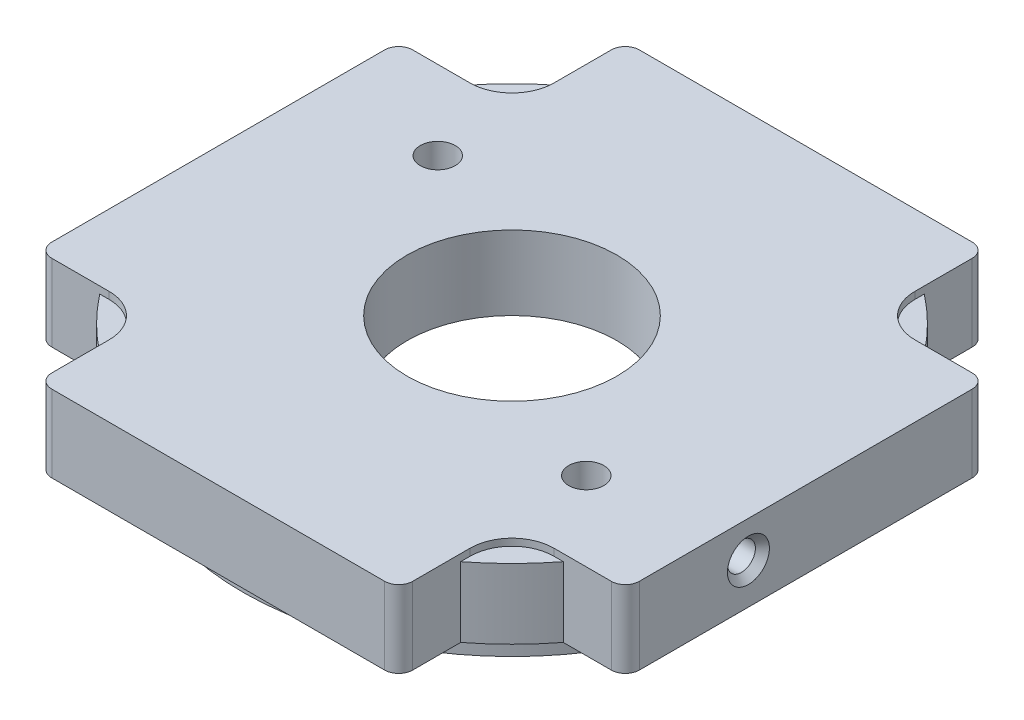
from build123d import *

# Parameters (mm, degrees)
SKETCH1_W                      = 42
SKETCH1_H                      = 42
BOSS_EXTRUDE1_DEPTH            = 5.5
CUT_EXTRUDE1_DEPTH             = 31.203476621
CUT_EXTRUDE2_REACH             = 32.116
CUT_EXTRUDE3_DEPTH             = 31.203476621
CUT_EXTRUDE4_REACH             = 32.116
CUT_EXTRUDE5_DEPTH             = 31.203476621
CUT_EXTRUDE6_REACH             = 32.116
CUT_EXTRUDE7_DEPTH             = 31.203476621
CUT_EXTRUDE8_REACH             = 32.116
BOSS_EXTRUDE2_DEPTH            = 2
F_2_5_2_5_DIAMETER_HOLE1_D     = 2.5
F_2_5_2_5_DIAMETER_HOLE1_DEPTH = 7.5
F_2_0_2_DIAMETER_HOLE1_D       = 2
F_2_0_2_DIAMETER_HOLE1_DEPTH   = 6.75
CHAMFER1_SIZE                  = 0.500038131
CHAMFER1_SIZE2                 = 0.50002542
FILLET1_R                      = 1
FILLET2_R                      = 3


with BuildPart() as part:
    # Sketch1 → Boss-Extrude1 (new body)
    with BuildSketch(Plane.XZ.offset(-2)):
        Rectangle(SKETCH1_W, SKETCH1_H)
    extrude(amount=-BOSS_EXTRUDE1_DEPTH)

    # Sketch2 → Cut-Extrude1 (cut, through all)
    with BuildSketch(Plane.XZ.offset(-2)):
        with BuildLine():
            Line((-12.9, -21), (-12.9, -16.570757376))
            ThreePointArc((-12.9, -16.570757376), (-14.849242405, -14.849242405), (-16.570757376, -12.9))
            Line((-16.570757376, -12.9), (-21, -12.9))
            Line((-21, -12.9), (-21, -21))
            Line((-21, -21), (-12.9, -21))
        make_face()
    extrude(amount=-CUT_EXTRUDE1_DEPTH, mode=Mode.SUBTRACT)

    # Sketch4 → Cut-Extrude2 (cut, up to next)
    with BuildSketch(Plane.XZ.offset(-7), mode=Mode.PRIVATE) as cut_extrude2_sk1:
        with BuildLine():
            Line((-12.9, -12.9), (-16.570757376, -12.9))
            ThreePointArc((-16.570757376, -12.9), (-14.849242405, -14.849242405), (-12.9, -16.570757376))
            Line((-12.9, -16.570757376), (-12.9, -12.9))
        make_face()
    cut_extrude2_tool1 = extrude(cut_extrude2_sk1.sketch, amount=-CUT_EXTRUDE2_REACH, mode=Mode.PRIVATE) & part.part
    add(cut_extrude2_tool1.solids().sort_by_distance((-14.173842, 7, -14.173842))[0], mode=Mode.SUBTRACT)

    # Sketch5 → Cut-Extrude3 (cut, through all)
    with BuildSketch(Plane.XZ.offset(-2)):
        with BuildLine():
            Line((-21, 12.9), (-16.570757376, 12.9))
            ThreePointArc((-16.570757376, 12.9), (-14.849242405, 14.849242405), (-12.9, 16.570757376))
            Line((-12.9, 16.570757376), (-12.9, 21))
            Line((-12.9, 21), (-21, 21))
            Line((-21, 21), (-21, 12.9))
        make_face()
    extrude(amount=-CUT_EXTRUDE3_DEPTH, mode=Mode.SUBTRACT)

    # Sketch7 → Cut-Extrude4 (cut, up to next)
    with BuildSketch(Plane.XZ.offset(-7), mode=Mode.PRIVATE) as cut_extrude4_sk1:
        with BuildLine():
            Line((-12.9, 12.9), (-12.9, 16.570757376))
            ThreePointArc((-12.9, 16.570757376), (-14.849242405, 14.849242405), (-16.570757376, 12.9))
            Line((-16.570757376, 12.9), (-12.9, 12.9))
        make_face()
    cut_extrude4_tool1 = extrude(cut_extrude4_sk1.sketch, amount=-CUT_EXTRUDE4_REACH, mode=Mode.PRIVATE) & part.part
    add(cut_extrude4_tool1.solids().sort_by_distance((-14.173842, 7, 14.173842))[0], mode=Mode.SUBTRACT)

    # Sketch8 → Cut-Extrude5 (cut, through all)
    with BuildSketch(Plane.XZ.offset(-2)):
        with BuildLine():
            Line((12.9, 21), (12.9, 16.570757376))
            ThreePointArc((12.9, 16.570757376), (14.849242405, 14.849242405), (16.570757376, 12.9))
            Line((16.570757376, 12.9), (21, 12.9))
            Line((21, 12.9), (21, 21))
            Line((21, 21), (12.9, 21))
        make_face()
    extrude(amount=-CUT_EXTRUDE5_DEPTH, mode=Mode.SUBTRACT)

    # Sketch10 → Cut-Extrude6 (cut, up to next)
    with BuildSketch(Plane.XZ.offset(-7), mode=Mode.PRIVATE) as cut_extrude6_sk1:
        with BuildLine():
            Line((12.9, 12.9), (16.570757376, 12.9))
            ThreePointArc((16.570757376, 12.9), (14.849242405, 14.849242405), (12.9, 16.570757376))
            Line((12.9, 16.570757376), (12.9, 12.9))
        make_face()
    cut_extrude6_tool1 = extrude(cut_extrude6_sk1.sketch, amount=-CUT_EXTRUDE6_REACH, mode=Mode.PRIVATE) & part.part
    add(cut_extrude6_tool1.solids().sort_by_distance((14.173842, 7, 14.173842))[0], mode=Mode.SUBTRACT)

    # Sketch11 → Cut-Extrude7 (cut, through all)
    with BuildSketch(Plane.XZ.offset(-2)):
        with BuildLine():
            Line((21, -12.9), (16.570757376, -12.9))
            ThreePointArc((16.570757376, -12.9), (14.849242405, -14.849242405), (12.9, -16.570757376))
            Line((12.9, -16.570757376), (12.9, -21))
            Line((12.9, -21), (21, -21))
            Line((21, -21), (21, -12.9))
        make_face()
    extrude(amount=-CUT_EXTRUDE7_DEPTH, mode=Mode.SUBTRACT)

    # Sketch13 → Cut-Extrude8 (cut, up to next)
    with BuildSketch(Plane.XZ.offset(-7), mode=Mode.PRIVATE) as cut_extrude8_sk1:
        with BuildLine():
            Line((12.9, -12.9), (12.9, -16.570757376))
            ThreePointArc((12.9, -16.570757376), (14.849242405, -14.849242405), (16.570757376, -12.9))
            Line((16.570757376, -12.9), (12.9, -12.9))
        make_face()
    cut_extrude8_tool1 = extrude(cut_extrude8_sk1.sketch, amount=-CUT_EXTRUDE8_REACH, mode=Mode.PRIVATE) & part.part
    add(cut_extrude8_tool1.solids().sort_by_distance((14.173842, 7, -14.173842))[0], mode=Mode.SUBTRACT)

    # Sketch14 → Boss-Extrude2 (add)
    with BuildSketch(Plane.XZ.offset(-2)):
        with BuildLine():
            Line((19.01479687, 3), (17.393173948, 3))
            ThreePointArc((17.393173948, 3), (17.65, 0), (17.393173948, -3))
            Line((17.393173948, -3), (19.01479687, -3))
            ThreePointArc((19.01479687, -3), (-19.25, 0), (19.01479687, 3))
        make_face()
    extrude(amount=BOSS_EXTRUDE2_DEPTH)

    # Sketch15 → Cut-Revolve1 (revolve, cut)
    with BuildSketch(Plane.XY, mode=Mode.PRIVATE) as cut_revolve1_sk:
        Polygon((7.5, 7.5), (0, 7.5), (0, 0), (17.65, 0), (17.65, 2.2), (7.5, 2.2), align=None)
    revolve(cut_revolve1_sk.sketch.rotate(Axis((0, 7.5, 0), (0, -1, 0)), 270), axis=Axis((0, 7.5, 0), (0, -1, 0)), mode=Mode.SUBTRACT)

    # 2.5 _2.5_ Diameter Hole1
    with Locations(Plane(origin=(0, 7.5, 0), x_dir=(-1, 0, 0), z_dir=(0, 1, 0))):
        with Locations((12.557368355, -7.25), (-12.557368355, 7.25)):
            Hole(F_2_5_2_5_DIAMETER_HOLE1_D / 2, depth=F_2_5_2_5_DIAMETER_HOLE1_DEPTH)

    # 2.0 _2_ Diameter Hole1
    with Locations(Plane(origin=(21, 0, 0), x_dir=(0, 0, -1), z_dir=(1, 0, 0))):
        with Locations((-4.1, 4.9)):
            Hole(F_2_0_2_DIAMETER_HOLE1_D / 2, depth=F_2_0_2_DIAMETER_HOLE1_DEPTH)

    # Chamfer1
    chamfer1_edges = [part.edges().sort_by_distance(p)[0] for p in [
        (21, 4.9, 3.1),
    ]]
    chamfer1_side = [part.faces().sort_by_distance(p)[0] for p in [
        (21, 4.746603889, -0.092827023),
    ]]
    chamfer(chamfer1_edges, length=CHAMFER1_SIZE, length2=CHAMFER1_SIZE2, reference=chamfer1_side[0])

    # Fillet1
    fillet1_edges = [part.edges().sort_by_distance(p)[0] for p in [
        (21, 4.75, -12.9),
        (12.9, 4.75, -21),
        (-12.9, 4.75, -21),
        (-21, 4.75, -12.9),
        (-21, 4.75, 12.9),
        (-12.9, 4.75, 21),
        (12.9, 4.75, 21),
        (21, 4.75, 12.9),
    ]]
    fillet(fillet1_edges, radius=FILLET1_R)

    # Fillet2
    fillet2_edges = [part.edges().sort_by_distance(p)[0] for p in [
        (12.9, 7.25, -12.9),
        (-12.9, 7.25, -12.9),
        (-12.9, 7.25, 12.9),
        (12.9, 7.25, 12.9),
    ]]
    fillet(fillet2_edges, radius=FILLET2_R)


solid = part.part
